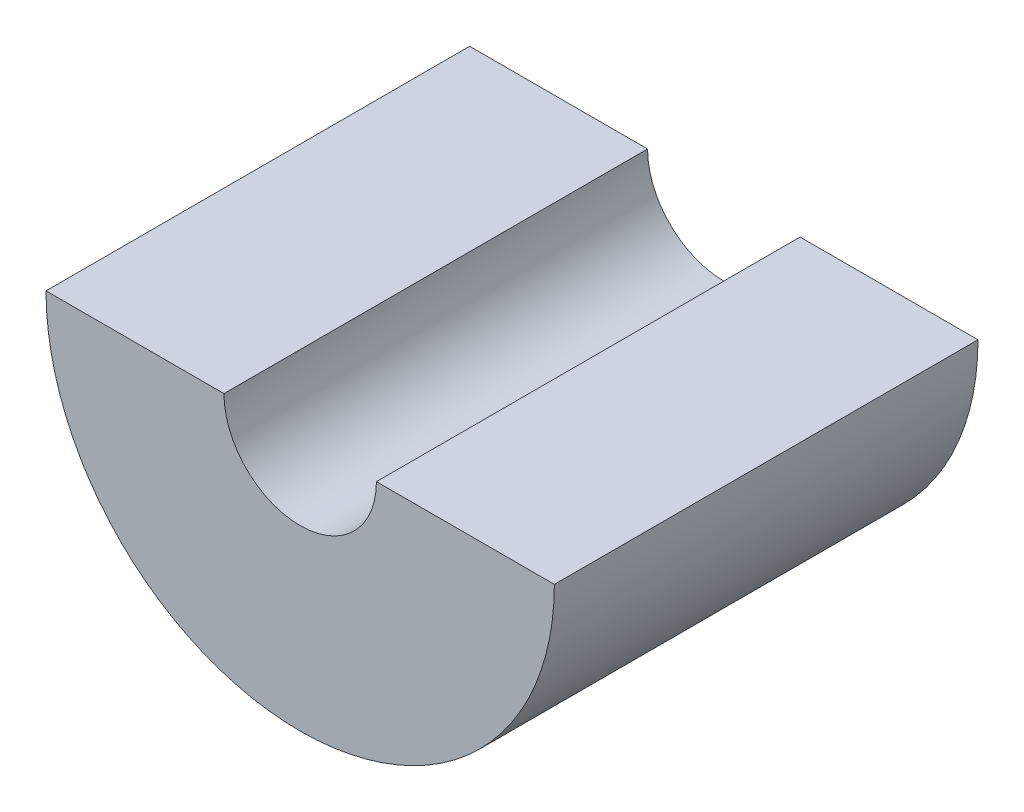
from build123d import *

# Parameters (mm, degrees)
EXTRUSION1_DEPTH                  = 50
DIAM_TRE_DU_PER_AGE_8_0_8_1_D     = 8
DIAM_TRE_DU_PER_AGE_8_0_8_1_DEPTH = 11
DIAM_TRE_DU_PER_AGE_8_0_8_1_TIP   = 2.403442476


with BuildPart() as part:
    # Esquisse1 → Extrusion1 (new body)
    with BuildSketch(Plane.XY):
        with BuildLine():
            Line((-30, 0), (-9, 0))
            ThreePointArc((-9, 0), (0, -9), (9, 0))
            Line((9, 0), (30, 0))
            ThreePointArc((30, 0), (0, -30), (-30, 0))
        make_face()
    extrude(amount=EXTRUSION1_DEPTH)

    # Diam_tre du per_age _8.0 _8_1
    with Locations(Plane(origin=(0, -30, 25), x_dir=(-1, 0, 0), z_dir=(0, -1, 0))):
        with Locations((0, 0)):
            Hole(DIAM_TRE_DU_PER_AGE_8_0_8_1_D / 2, depth=DIAM_TRE_DU_PER_AGE_8_0_8_1_DEPTH)
            with Locations((0, 0, -(DIAM_TRE_DU_PER_AGE_8_0_8_1_DEPTH + DIAM_TRE_DU_PER_AGE_8_0_8_1_TIP / 2))):  # 118° drill point
                Cone(0, DIAM_TRE_DU_PER_AGE_8_0_8_1_D / 2, DIAM_TRE_DU_PER_AGE_8_0_8_1_TIP, mode=Mode.SUBTRACT)


solid = part.part
